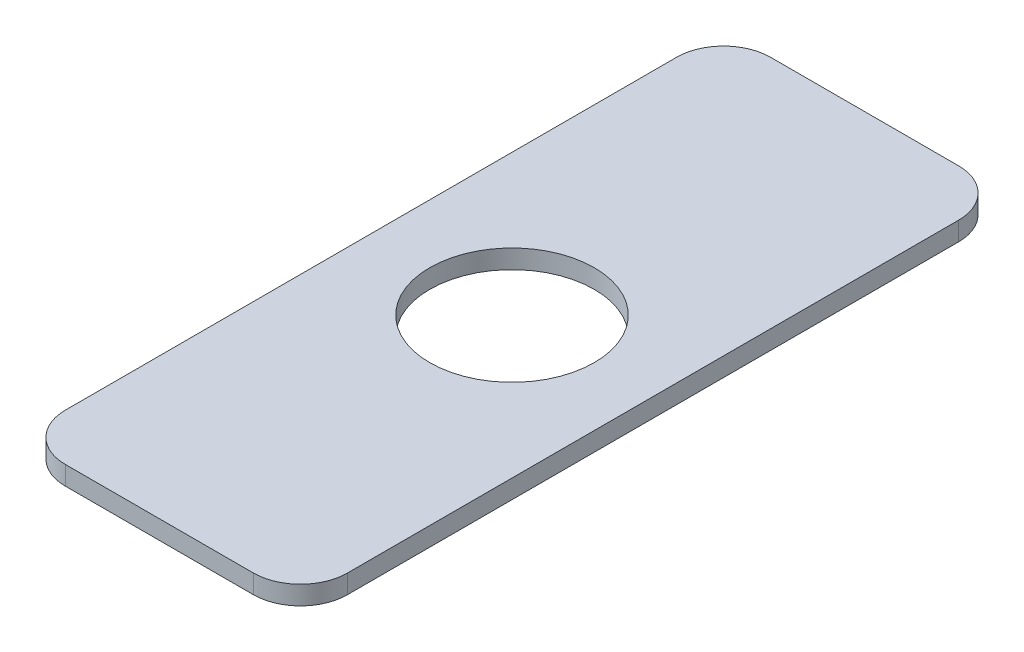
from build123d import *

# Parameters (mm, degrees)
SKETCH1_W           = 60
SKETCH1_H           = 150
BOSS_EXTRUDE1_DEPTH = 4
FILLET1_R           = 10
SKETCH2_R           = 17.5
CUT_EXTRUDE1_DEPTH  = 4


with BuildPart() as part:
    # Sketch1 → Boss-Extrude1 (new body)
    with BuildSketch(Plane(origin=(0, 0, 0), x_dir=(1, 0, 0), z_dir=(0, 1, 0))):
        Rectangle(SKETCH1_W, SKETCH1_H)
    extrude(amount=BOSS_EXTRUDE1_DEPTH)

    # Fillet1
    fillet1_edges = [part.edges().sort_by_distance(p)[0] for p in [
        (30, 2, 75),
        (-30, 2, 75),
        (-30, 2, -75),
        (30, 2, -75),
    ]]
    fillet(fillet1_edges, radius=FILLET1_R)

    # Sketch2 → Cut-Extrude1 (cut)
    with BuildSketch(Plane(origin=(0, 4, 0), x_dir=(1, 0, 0), z_dir=(0, 1, 0))):
        with Locations(Location((0, 0, 0), (0, 0, 270))):
            Circle(SKETCH2_R)
    extrude(amount=-CUT_EXTRUDE1_DEPTH, mode=Mode.SUBTRACT)


solid = part.part
